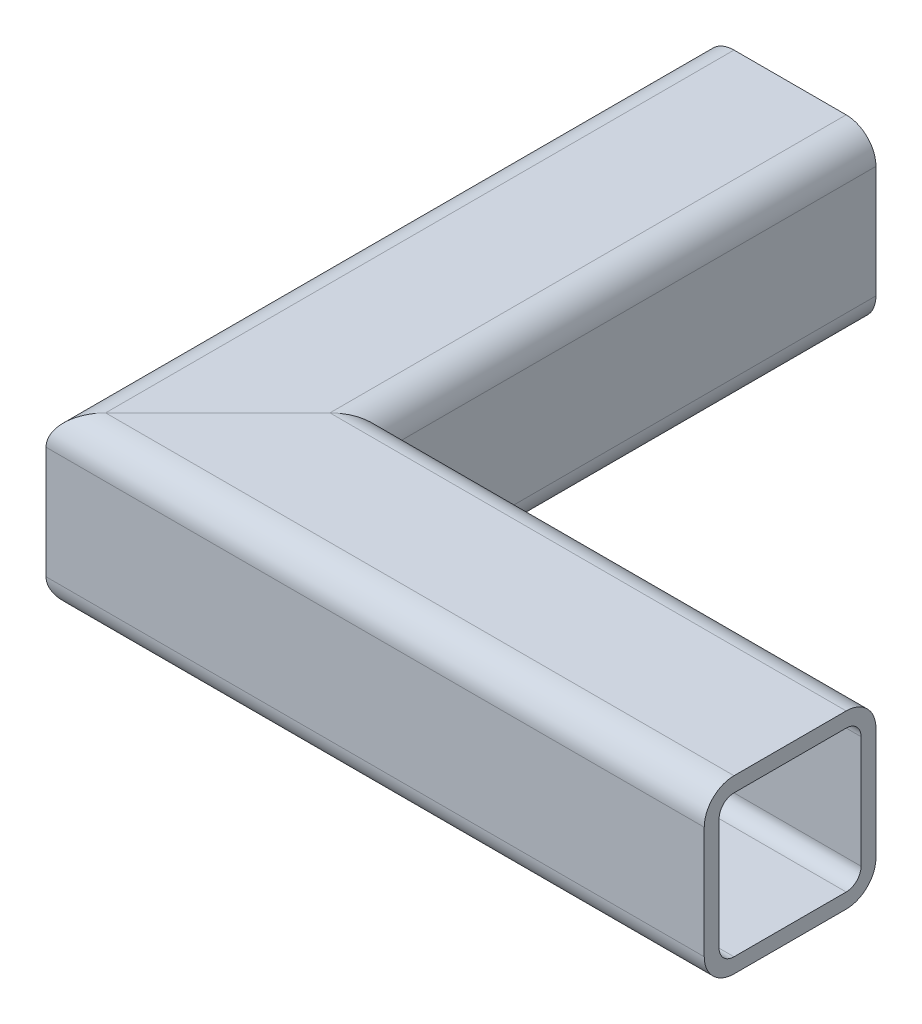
ISO-10303-21;
HEADER;
FILE_DESCRIPTION(('STEP AP214'),'2;1');
FILE_NAME('part.step','',(''),(''),'','','');
FILE_SCHEMA(('AUTOMOTIVE_DESIGN { 1 0 10303 214 1 1 1 1 }'));
ENDSEC;
DATA;
#1=APPLICATION_CONTEXT('core data for automotive mechanical design processes');
#2=APPLICATION_PROTOCOL_DEFINITION('international standard','automotive_design',2000,#1);
#3=PRODUCT_CONTEXT('',#1,'mechanical');
#4=PRODUCT('Part','Part','',(#3));
#5=PRODUCT_RELATED_PRODUCT_CATEGORY('part','',(#4));
#6=PRODUCT_DEFINITION_FORMATION('','',#4);
#7=PRODUCT_DEFINITION_CONTEXT('part definition',#1,'design');
#8=PRODUCT_DEFINITION('design','',#6,#7);
#9=PRODUCT_DEFINITION_SHAPE('','',#8);
#10=(LENGTH_UNIT() NAMED_UNIT(*) SI_UNIT(.MILLI.,.METRE.));
#11=(NAMED_UNIT(*) PLANE_ANGLE_UNIT() SI_UNIT($,.RADIAN.));
#12=(NAMED_UNIT(*) SI_UNIT($,.STERADIAN.) SOLID_ANGLE_UNIT());
#13=UNCERTAINTY_MEASURE_WITH_UNIT(LENGTH_MEASURE(1.E-05),#10,'distance_accuracy_value','');
#14=(GEOMETRIC_REPRESENTATION_CONTEXT(3) GLOBAL_UNCERTAINTY_ASSIGNED_CONTEXT((#13)) GLOBAL_UNIT_ASSIGNED_CONTEXT((#10,
#11,#12)) REPRESENTATION_CONTEXT('',''));
#15=CARTESIAN_POINT('',(0.,0.,0.));
#16=DIRECTION('',(0.,0.,1.));
#17=DIRECTION('',(1.,0.,0.));
#18=AXIS2_PLACEMENT_3D('',#15,#16,#17);
#19=CARTESIAN_POINT('',(-12.4,-9.8,0.));
#20=DIRECTION('',(1.,0.,0.));
#21=DIRECTION('',(0.,0.,-1.));
#22=AXIS2_PLACEMENT_3D('',#19,#20,#21);
#23=PLANE('',#22);
#24=DIRECTION('',(0.,1.,0.));
#25=VECTOR('',#24,1.);
#26=CARTESIAN_POINT('',(-12.4,-9.8,12.4));
#27=LINE('',#26,#25);
#28=CARTESIAN_POINT('',(-12.4,-9.8,12.4));
#29=VERTEX_POINT('',#28);
#30=CARTESIAN_POINT('',(-12.4,9.8,12.4));
#31=VERTEX_POINT('',#30);
#32=EDGE_CURVE('E13',#29,#31,#27,.T.);
#33=ORIENTED_EDGE('',*,*,#32,.F.);
#34=DIRECTION('',(0.,0.,-1.));
#35=VECTOR('',#34,1.);
#36=CARTESIAN_POINT('',(-12.4,-9.8,0.));
#37=LINE('',#36,#35);
#38=CARTESIAN_POINT('',(-12.4,-9.8,-100.));
#39=VERTEX_POINT('',#38);
#40=EDGE_CURVE('E356',#29,#39,#37,.T.);
#41=ORIENTED_EDGE('',*,*,#40,.T.);
#42=DIRECTION('',(0.,-1.,0.));
#43=VECTOR('',#42,1.);
#44=CARTESIAN_POINT('',(-12.4,-9.8,-100.));
#45=LINE('',#44,#43);
#46=CARTESIAN_POINT('',(-12.4,9.8,-100.));
#47=VERTEX_POINT('',#46);
#48=EDGE_CURVE('E314',#47,#39,#45,.T.);
#49=ORIENTED_EDGE('',*,*,#48,.F.);
#50=DIRECTION('',(0.,0.,-1.));
#51=VECTOR('',#50,1.);
#52=CARTESIAN_POINT('',(-12.4,9.8,0.));
#53=LINE('',#52,#51);
#54=EDGE_CURVE('E289',#31,#47,#53,.T.);
#55=ORIENTED_EDGE('',*,*,#54,.F.);
#56=EDGE_LOOP('',(#33,#41,#49,#55));
#57=FACE_BOUND('',#56,.T.);
#58=ADVANCED_FACE('F153',(#57),#23,.T.);
#59=CARTESIAN_POINT('',(-9.8,-9.8,0.));
#60=DIRECTION('',(0.,0.,-1.));
#61=DIRECTION('',(-1.,0.,0.));
#62=AXIS2_PLACEMENT_3D('',#59,#60,#61);
#63=CYLINDRICAL_SURFACE('',#62,2.6);
#64=CARTESIAN_POINT('',(-9.8,-9.8,9.8));
#65=DIRECTION('',(-0.707106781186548,0.,-0.707106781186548));
#66=DIRECTION('',(0.707106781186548,0.,-0.707106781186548));
#67=AXIS2_PLACEMENT_3D('',#64,#65,#66);
#68=ELLIPSE('',#67,3.67695526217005,2.6);
#69=CARTESIAN_POINT('',(-9.8,-12.4,9.8));
#70=VERTEX_POINT('',#69);
#71=EDGE_CURVE('E397',#70,#29,#68,.T.);
#72=ORIENTED_EDGE('',*,*,#71,.F.);
#73=DIRECTION('',(0.,0.,-1.));
#74=VECTOR('',#73,1.);
#75=CARTESIAN_POINT('',(-9.8,-12.4,0.));
#76=LINE('',#75,#74);
#77=CARTESIAN_POINT('',(-9.8,-12.4,-100.));
#78=VERTEX_POINT('',#77);
#79=EDGE_CURVE('E358',#70,#78,#76,.T.);
#80=ORIENTED_EDGE('',*,*,#79,.T.);
#81=CARTESIAN_POINT('',(-9.8,-9.8,-100.));
#82=DIRECTION('',(0.,0.,1.));
#83=DIRECTION('',(1.,0.,0.));
#84=AXIS2_PLACEMENT_3D('',#81,#82,#83);
#85=CIRCLE('',#84,2.6);
#86=EDGE_CURVE('E311',#39,#78,#85,.T.);
#87=ORIENTED_EDGE('',*,*,#86,.F.);
#88=ORIENTED_EDGE('',*,*,#40,.F.);
#89=EDGE_LOOP('',(#72,#80,#87,#88));
#90=FACE_BOUND('',#89,.T.);
#91=ADVANCED_FACE('F414',(#90),#63,.F.);
#92=CARTESIAN_POINT('',(-9.8,-12.4,0.));
#93=DIRECTION('',(0.,1.,0.));
#94=DIRECTION('',(0.,0.,1.));
#95=AXIS2_PLACEMENT_3D('',#92,#93,#94);
#96=PLANE('',#95);
#97=DIRECTION('',(-0.707106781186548,0.,0.707106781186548));
#98=VECTOR('',#97,1.);
#99=CARTESIAN_POINT('',(-4.9,-12.4,4.9));
#100=LINE('',#99,#98);
#101=CARTESIAN_POINT('',(9.80000000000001,-12.4,-9.8));
#102=VERTEX_POINT('',#101);
#103=EDGE_CURVE('E201',#102,#70,#100,.T.);
#104=ORIENTED_EDGE('',*,*,#103,.F.);
#105=DIRECTION('',(0.,0.,-1.));
#106=VECTOR('',#105,1.);
#107=CARTESIAN_POINT('',(9.8,-12.4,0.));
#108=LINE('',#107,#106);
#109=CARTESIAN_POINT('',(9.80000000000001,-12.4,-100.));
#110=VERTEX_POINT('',#109);
#111=EDGE_CURVE('E360',#102,#110,#108,.T.);
#112=ORIENTED_EDGE('',*,*,#111,.T.);
#113=DIRECTION('',(1.,0.,0.));
#114=VECTOR('',#113,1.);
#115=CARTESIAN_POINT('',(-9.8,-12.4,-100.));
#116=LINE('',#115,#114);
#117=EDGE_CURVE('E308',#78,#110,#116,.T.);
#118=ORIENTED_EDGE('',*,*,#117,.F.);
#119=ORIENTED_EDGE('',*,*,#79,.F.);
#120=EDGE_LOOP('',(#104,#112,#118,#119));
#121=FACE_BOUND('',#120,.T.);
#122=ADVANCED_FACE('F406',(#121),#96,.T.);
#123=CARTESIAN_POINT('',(9.8,-9.8,0.));
#124=DIRECTION('',(0.,0.,-1.));
#125=DIRECTION('',(-1.,0.,0.));
#126=AXIS2_PLACEMENT_3D('',#123,#124,#125);
#127=CYLINDRICAL_SURFACE('',#126,2.6);
#128=CARTESIAN_POINT('',(9.8,-9.8,-9.8));
#129=DIRECTION('',(-0.707106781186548,0.,-0.707106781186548));
#130=DIRECTION('',(0.707106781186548,0.,-0.707106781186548));
#131=AXIS2_PLACEMENT_3D('',#128,#129,#130);
#132=ELLIPSE('',#131,3.67695526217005,2.6);
#133=CARTESIAN_POINT('',(12.4,-9.8,-12.4));
#134=VERTEX_POINT('',#133);
#135=EDGE_CURVE('E376',#134,#102,#132,.T.);
#136=ORIENTED_EDGE('',*,*,#135,.F.);
#137=DIRECTION('',(0.,0.,-1.));
#138=VECTOR('',#137,1.);
#139=CARTESIAN_POINT('',(12.4,-9.8,0.));
#140=LINE('',#139,#138);
#141=CARTESIAN_POINT('',(12.4,-9.8,-100.));
#142=VERTEX_POINT('',#141);
#143=EDGE_CURVE('E362',#134,#142,#140,.T.);
#144=ORIENTED_EDGE('',*,*,#143,.T.);
#145=CARTESIAN_POINT('',(9.80000000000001,-9.8,-100.));
#146=DIRECTION('',(0.,0.,1.));
#147=DIRECTION('',(1.,0.,0.));
#148=AXIS2_PLACEMENT_3D('',#145,#146,#147);
#149=CIRCLE('',#148,2.6);
#150=EDGE_CURVE('E305',#110,#142,#149,.T.);
#151=ORIENTED_EDGE('',*,*,#150,.F.);
#152=ORIENTED_EDGE('',*,*,#111,.F.);
#153=EDGE_LOOP('',(#136,#144,#151,#152));
#154=FACE_BOUND('',#153,.T.);
#155=ADVANCED_FACE('F409',(#154),#127,.F.);
#156=CARTESIAN_POINT('',(12.4,9.8,0.));
#157=DIRECTION('',(-1.,0.,0.));
#158=DIRECTION('',(0.,0.,1.));
#159=AXIS2_PLACEMENT_3D('',#156,#157,#158);
#160=PLANE('',#159);
#161=DIRECTION('',(0.,-1.,0.));
#162=VECTOR('',#161,1.);
#163=CARTESIAN_POINT('',(12.4,9.8,-12.4));
#164=LINE('',#163,#162);
#165=CARTESIAN_POINT('',(12.4,9.8,-12.4));
#166=VERTEX_POINT('',#165);
#167=EDGE_CURVE('E372',#166,#134,#164,.T.);
#168=ORIENTED_EDGE('',*,*,#167,.F.);
#169=DIRECTION('',(0.,0.,-1.));
#170=VECTOR('',#169,1.);
#171=CARTESIAN_POINT('',(12.4,9.8,0.));
#172=LINE('',#171,#170);
#173=CARTESIAN_POINT('',(12.4,9.8,-100.));
#174=VERTEX_POINT('',#173);
#175=EDGE_CURVE('E364',#166,#174,#172,.T.);
#176=ORIENTED_EDGE('',*,*,#175,.T.);
#177=DIRECTION('',(0.,1.,0.));
#178=VECTOR('',#177,1.);
#179=CARTESIAN_POINT('',(12.4,9.8,-100.));
#180=LINE('',#179,#178);
#181=EDGE_CURVE('E300',#142,#174,#180,.T.);
#182=ORIENTED_EDGE('',*,*,#181,.F.);
#183=ORIENTED_EDGE('',*,*,#143,.F.);
#184=EDGE_LOOP('',(#168,#176,#182,#183));
#185=FACE_BOUND('',#184,.T.);
#186=ADVANCED_FACE('F431',(#185),#160,.T.);
#187=CARTESIAN_POINT('',(9.80000000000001,9.8,0.));
#188=DIRECTION('',(0.,0.,-1.));
#189=DIRECTION('',(-1.,0.,0.));
#190=AXIS2_PLACEMENT_3D('',#187,#188,#189);
#191=CYLINDRICAL_SURFACE('',#190,2.6);
#192=CARTESIAN_POINT('',(9.8,9.8,-9.8));
#193=DIRECTION('',(-0.707106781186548,0.,-0.707106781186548));
#194=DIRECTION('',(0.707106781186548,0.,-0.707106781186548));
#195=AXIS2_PLACEMENT_3D('',#192,#193,#194);
#196=ELLIPSE('',#195,3.67695526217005,2.6);
#197=CARTESIAN_POINT('',(9.8,12.4,-9.8));
#198=VERTEX_POINT('',#197);
#199=EDGE_CURVE('E370',#198,#166,#196,.T.);
#200=ORIENTED_EDGE('',*,*,#199,.F.);
#201=DIRECTION('',(0.,0.,-1.));
#202=VECTOR('',#201,1.);
#203=CARTESIAN_POINT('',(9.8,12.4,0.));
#204=LINE('',#203,#202);
#205=CARTESIAN_POINT('',(9.80000000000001,12.4,-100.));
#206=VERTEX_POINT('',#205);
#207=EDGE_CURVE('E285',#198,#206,#204,.T.);
#208=ORIENTED_EDGE('',*,*,#207,.T.);
#209=CARTESIAN_POINT('',(9.80000000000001,9.8,-100.));
#210=DIRECTION('',(0.,0.,1.));
#211=DIRECTION('',(1.,0.,0.));
#212=AXIS2_PLACEMENT_3D('',#209,#210,#211);
#213=CIRCLE('',#212,2.6);
#214=EDGE_CURVE('E298',#174,#206,#213,.T.);
#215=ORIENTED_EDGE('',*,*,#214,.F.);
#216=ORIENTED_EDGE('',*,*,#175,.F.);
#217=EDGE_LOOP('',(#200,#208,#215,#216));
#218=FACE_BOUND('',#217,.T.);
#219=ADVANCED_FACE('F368',(#218),#191,.F.);
#220=CARTESIAN_POINT('',(9.8,12.4,0.));
#221=DIRECTION('',(0.,-1.,0.));
#222=DIRECTION('',(0.,0.,-1.));
#223=AXIS2_PLACEMENT_3D('',#220,#221,#222);
#224=PLANE('',#223);
#225=DIRECTION('',(0.707106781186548,0.,-0.707106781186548));
#226=VECTOR('',#225,1.);
#227=CARTESIAN_POINT('',(4.9,12.4,-4.9));
#228=LINE('',#227,#226);
#229=CARTESIAN_POINT('',(-9.80000000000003,12.4,9.80000000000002));
#230=VERTEX_POINT('',#229);
#231=EDGE_CURVE('E281',#230,#198,#228,.T.);
#232=ORIENTED_EDGE('',*,*,#231,.F.);
#233=DIRECTION('',(0.,0.,-1.));
#234=VECTOR('',#233,1.);
#235=CARTESIAN_POINT('',(-9.8,12.4,0.));
#236=LINE('',#235,#234);
#237=CARTESIAN_POINT('',(-9.8,12.4,-100.));
#238=VERTEX_POINT('',#237);
#239=EDGE_CURVE('E274',#230,#238,#236,.T.);
#240=ORIENTED_EDGE('',*,*,#239,.T.);
#241=DIRECTION('',(-1.,0.,0.));
#242=VECTOR('',#241,1.);
#243=CARTESIAN_POINT('',(9.80000000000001,12.4,-100.));
#244=LINE('',#243,#242);
#245=EDGE_CURVE('E279',#206,#238,#244,.T.);
#246=ORIENTED_EDGE('',*,*,#245,.F.);
#247=ORIENTED_EDGE('',*,*,#207,.F.);
#248=EDGE_LOOP('',(#232,#240,#246,#247));
#249=FACE_BOUND('',#248,.T.);
#250=ADVANCED_FACE('F276',(#249),#224,.T.);
#251=CARTESIAN_POINT('',(-9.8,9.8,0.));
#252=DIRECTION('',(0.,0.,-1.));
#253=DIRECTION('',(-1.,0.,0.));
#254=AXIS2_PLACEMENT_3D('',#251,#252,#253);
#255=CYLINDRICAL_SURFACE('',#254,2.6);
#256=CARTESIAN_POINT('',(-9.8,9.8,9.8));
#257=DIRECTION('',(-0.707106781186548,0.,-0.707106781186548));
#258=DIRECTION('',(0.707106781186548,0.,-0.707106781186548));
#259=AXIS2_PLACEMENT_3D('',#256,#257,#258);
#260=ELLIPSE('',#259,3.67695526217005,2.6);
#261=EDGE_CURVE('E374',#31,#230,#260,.T.);
#262=ORIENTED_EDGE('',*,*,#261,.F.);
#263=ORIENTED_EDGE('',*,*,#54,.T.);
#264=CARTESIAN_POINT('',(-9.8,9.8,-100.));
#265=DIRECTION('',(0.,0.,1.));
#266=DIRECTION('',(1.,0.,0.));
#267=AXIS2_PLACEMENT_3D('',#264,#265,#266);
#268=CIRCLE('',#267,2.6);
#269=EDGE_CURVE('E287',#238,#47,#268,.T.);
#270=ORIENTED_EDGE('',*,*,#269,.F.);
#271=ORIENTED_EDGE('',*,*,#239,.F.);
#272=EDGE_LOOP('',(#262,#263,#270,#271));
#273=FACE_BOUND('',#272,.T.);
#274=ADVANCED_FACE('F155',(#273),#255,.F.);
#275=CARTESIAN_POINT('',(9.80000000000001,9.8,-100.));
#276=DIRECTION('',(0.,0.,1.));
#277=DIRECTION('',(1.,0.,0.));
#278=AXIS2_PLACEMENT_3D('',#275,#276,#277);
#279=PLANE('',#278);
#280=ORIENTED_EDGE('',*,*,#269,.T.);
#281=ORIENTED_EDGE('',*,*,#48,.T.);
#282=ORIENTED_EDGE('',*,*,#86,.T.);
#283=ORIENTED_EDGE('',*,*,#117,.T.);
#284=ORIENTED_EDGE('',*,*,#150,.T.);
#285=ORIENTED_EDGE('',*,*,#181,.T.);
#286=ORIENTED_EDGE('',*,*,#214,.T.);
#287=ORIENTED_EDGE('',*,*,#245,.T.);
#288=EDGE_LOOP('',(#280,#281,#282,#283,#284,#285,#286,#287));
#289=FACE_BOUND('',#288,.T.);
#290=CARTESIAN_POINT('',(9.80000000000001,9.8,-100.));
#291=DIRECTION('',(0.,0.,1.));
#292=DIRECTION('',(1.,0.,0.));
#293=AXIS2_PLACEMENT_3D('',#290,#291,#292);
#294=CIRCLE('',#293,5.2);
#295=CARTESIAN_POINT('',(15.,9.8,-100.));
#296=VERTEX_POINT('',#295);
#297=CARTESIAN_POINT('',(9.80000000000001,15.,-100.));
#298=VERTEX_POINT('',#297);
#299=EDGE_CURVE('E316',#296,#298,#294,.T.);
#300=ORIENTED_EDGE('',*,*,#299,.F.);
#301=DIRECTION('',(0.,1.,0.));
#302=VECTOR('',#301,1.);
#303=CARTESIAN_POINT('',(15.,9.8,-100.));
#304=LINE('',#303,#302);
#305=CARTESIAN_POINT('',(15.,-9.8,-100.));
#306=VERTEX_POINT('',#305);
#307=EDGE_CURVE('E337',#306,#296,#304,.T.);
#308=ORIENTED_EDGE('',*,*,#307,.F.);
#309=CARTESIAN_POINT('',(9.80000000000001,-9.8,-100.));
#310=DIRECTION('',(0.,0.,1.));
#311=DIRECTION('',(1.,0.,0.));
#312=AXIS2_PLACEMENT_3D('',#309,#310,#311);
#313=CIRCLE('',#312,5.2);
#314=CARTESIAN_POINT('',(9.80000000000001,-15.,-100.));
#315=VERTEX_POINT('',#314);
#316=EDGE_CURVE('E334',#315,#306,#313,.T.);
#317=ORIENTED_EDGE('',*,*,#316,.F.);
#318=DIRECTION('',(1.,0.,0.));
#319=VECTOR('',#318,1.);
#320=CARTESIAN_POINT('',(-9.8,-15.,-100.));
#321=LINE('',#320,#319);
#322=CARTESIAN_POINT('',(-9.8,-15.,-100.));
#323=VERTEX_POINT('',#322);
#324=EDGE_CURVE('E331',#323,#315,#321,.T.);
#325=ORIENTED_EDGE('',*,*,#324,.F.);
#326=CARTESIAN_POINT('',(-9.8,-9.8,-100.));
#327=DIRECTION('',(0.,0.,1.));
#328=DIRECTION('',(1.,0.,0.));
#329=AXIS2_PLACEMENT_3D('',#326,#327,#328);
#330=CIRCLE('',#329,5.2);
#331=CARTESIAN_POINT('',(-15.,-9.8,-100.));
#332=VERTEX_POINT('',#331);
#333=EDGE_CURVE('E328',#332,#323,#330,.T.);
#334=ORIENTED_EDGE('',*,*,#333,.F.);
#335=DIRECTION('',(0.,-1.,0.));
#336=VECTOR('',#335,1.);
#337=CARTESIAN_POINT('',(-15.,-9.8,-100.));
#338=LINE('',#337,#336);
#339=CARTESIAN_POINT('',(-15.,9.8,-100.));
#340=VERTEX_POINT('',#339);
#341=EDGE_CURVE('E325',#340,#332,#338,.T.);
#342=ORIENTED_EDGE('',*,*,#341,.F.);
#343=CARTESIAN_POINT('',(-9.8,9.8,-100.));
#344=DIRECTION('',(0.,0.,1.));
#345=DIRECTION('',(1.,0.,0.));
#346=AXIS2_PLACEMENT_3D('',#343,#344,#345);
#347=CIRCLE('',#346,5.2);
#348=CARTESIAN_POINT('',(-9.8,15.,-100.));
#349=VERTEX_POINT('',#348);
#350=EDGE_CURVE('E322',#349,#340,#347,.T.);
#351=ORIENTED_EDGE('',*,*,#350,.F.);
#352=DIRECTION('',(-1.,0.,0.));
#353=VECTOR('',#352,1.);
#354=CARTESIAN_POINT('',(9.80000000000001,15.,-100.));
#355=LINE('',#354,#353);
#356=EDGE_CURVE('E319',#298,#349,#355,.T.);
#357=ORIENTED_EDGE('',*,*,#356,.F.);
#358=EDGE_LOOP('',(#300,#308,#317,#325,#334,#342,#351,#357));
#359=FACE_BOUND('',#358,.T.);
#360=ADVANCED_FACE('F294',(#289,#359),#279,.F.);
#361=CARTESIAN_POINT('',(15.,9.8,0.));
#362=DIRECTION('',(-1.,0.,0.));
#363=DIRECTION('',(0.,0.,1.));
#364=AXIS2_PLACEMENT_3D('',#361,#362,#363);
#365=PLANE('',#364);
#366=DIRECTION('',(0.,0.,-1.));
#367=VECTOR('',#366,1.);
#368=CARTESIAN_POINT('',(15.,9.8,0.));
#369=LINE('',#368,#367);
#370=CARTESIAN_POINT('',(15.,9.8,-15.));
#371=VERTEX_POINT('',#370);
#372=EDGE_CURVE('E284',#371,#296,#369,.T.);
#373=ORIENTED_EDGE('',*,*,#372,.F.);
#374=DIRECTION('',(0.,-1.,0.));
#375=VECTOR('',#374,1.);
#376=CARTESIAN_POINT('',(15.,9.8,-15.));
#377=LINE('',#376,#375);
#378=CARTESIAN_POINT('',(15.,-9.8,-15.));
#379=VERTEX_POINT('',#378);
#380=EDGE_CURVE('E157',#371,#379,#377,.T.);
#381=ORIENTED_EDGE('',*,*,#380,.T.);
#382=DIRECTION('',(0.,0.,-1.));
#383=VECTOR('',#382,1.);
#384=CARTESIAN_POINT('',(15.,-9.8,0.));
#385=LINE('',#384,#383);
#386=EDGE_CURVE('E341',#379,#306,#385,.T.);
#387=ORIENTED_EDGE('',*,*,#386,.T.);
#388=ORIENTED_EDGE('',*,*,#307,.T.);
#389=EDGE_LOOP('',(#373,#381,#387,#388));
#390=FACE_BOUND('',#389,.T.);
#391=ADVANCED_FACE('F443',(#390),#365,.F.);
#392=CARTESIAN_POINT('',(9.8,-9.8,0.));
#393=DIRECTION('',(0.,0.,-1.));
#394=DIRECTION('',(-1.,0.,0.));
#395=AXIS2_PLACEMENT_3D('',#392,#393,#394);
#396=CYLINDRICAL_SURFACE('',#395,5.2);
#397=ORIENTED_EDGE('',*,*,#386,.F.);
#398=CARTESIAN_POINT('',(9.8,-9.8,-9.8));
#399=DIRECTION('',(-0.707106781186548,0.,-0.707106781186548));
#400=DIRECTION('',(0.707106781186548,0.,-0.707106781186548));
#401=AXIS2_PLACEMENT_3D('',#398,#399,#400);
#402=ELLIPSE('',#401,7.35391052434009,5.2);
#403=CARTESIAN_POINT('',(9.80000000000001,-15.,-9.8));
#404=VERTEX_POINT('',#403);
#405=EDGE_CURVE('E379',#379,#404,#402,.T.);
#406=ORIENTED_EDGE('',*,*,#405,.T.);
#407=DIRECTION('',(0.,0.,-1.));
#408=VECTOR('',#407,1.);
#409=CARTESIAN_POINT('',(9.80000000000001,-15.,0.));
#410=LINE('',#409,#408);
#411=EDGE_CURVE('E343',#404,#315,#410,.T.);
#412=ORIENTED_EDGE('',*,*,#411,.T.);
#413=ORIENTED_EDGE('',*,*,#316,.T.);
#414=EDGE_LOOP('',(#397,#406,#412,#413));
#415=FACE_BOUND('',#414,.T.);
#416=ADVANCED_FACE('F448',(#415),#396,.T.);
#417=CARTESIAN_POINT('',(-9.8,-15.,0.));
#418=DIRECTION('',(0.,1.,0.));
#419=DIRECTION('',(0.,0.,1.));
#420=AXIS2_PLACEMENT_3D('',#417,#418,#419);
#421=PLANE('',#420);
#422=ORIENTED_EDGE('',*,*,#411,.F.);
#423=DIRECTION('',(-0.707106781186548,0.,0.707106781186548));
#424=VECTOR('',#423,1.);
#425=CARTESIAN_POINT('',(-4.9,-15.,4.9));
#426=LINE('',#425,#424);
#427=CARTESIAN_POINT('',(-9.80000000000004,-15.,9.80000000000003));
#428=VERTEX_POINT('',#427);
#429=EDGE_CURVE('E188',#404,#428,#426,.T.);
#430=ORIENTED_EDGE('',*,*,#429,.T.);
#431=DIRECTION('',(0.,0.,-1.));
#432=VECTOR('',#431,1.);
#433=CARTESIAN_POINT('',(-9.8,-15.,0.));
#434=LINE('',#433,#432);
#435=EDGE_CURVE('E345',#428,#323,#434,.T.);
#436=ORIENTED_EDGE('',*,*,#435,.T.);
#437=ORIENTED_EDGE('',*,*,#324,.T.);
#438=EDGE_LOOP('',(#422,#430,#436,#437));
#439=FACE_BOUND('',#438,.T.);
#440=ADVANCED_FACE('F455',(#439),#421,.F.);
#441=CARTESIAN_POINT('',(-9.8,-9.8,0.));
#442=DIRECTION('',(0.,0.,-1.));
#443=DIRECTION('',(-1.,0.,0.));
#444=AXIS2_PLACEMENT_3D('',#441,#442,#443);
#445=CYLINDRICAL_SURFACE('',#444,5.2);
#446=ORIENTED_EDGE('',*,*,#435,.F.);
#447=CARTESIAN_POINT('',(-9.8,-9.8,9.8));
#448=DIRECTION('',(-0.707106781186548,0.,-0.707106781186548));
#449=DIRECTION('',(0.707106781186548,0.,-0.707106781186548));
#450=AXIS2_PLACEMENT_3D('',#447,#448,#449);
#451=ELLIPSE('',#450,7.35391052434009,5.2);
#452=CARTESIAN_POINT('',(-15.,-9.8,15.));
#453=VERTEX_POINT('',#452);
#454=EDGE_CURVE('E384',#428,#453,#451,.T.);
#455=ORIENTED_EDGE('',*,*,#454,.T.);
#456=DIRECTION('',(0.,0.,-1.));
#457=VECTOR('',#456,1.);
#458=CARTESIAN_POINT('',(-15.,-9.8,0.));
#459=LINE('',#458,#457);
#460=EDGE_CURVE('E347',#453,#332,#459,.T.);
#461=ORIENTED_EDGE('',*,*,#460,.T.);
#462=ORIENTED_EDGE('',*,*,#333,.T.);
#463=EDGE_LOOP('',(#446,#455,#461,#462));
#464=FACE_BOUND('',#463,.T.);
#465=ADVANCED_FACE('F458',(#464),#445,.T.);
#466=CARTESIAN_POINT('',(-15.,-9.8,0.));
#467=DIRECTION('',(1.,0.,0.));
#468=DIRECTION('',(0.,0.,-1.));
#469=AXIS2_PLACEMENT_3D('',#466,#467,#468);
#470=PLANE('',#469);
#471=ORIENTED_EDGE('',*,*,#460,.F.);
#472=DIRECTION('',(0.,1.,0.));
#473=VECTOR('',#472,1.);
#474=CARTESIAN_POINT('',(-15.,-9.8,15.));
#475=LINE('',#474,#473);
#476=CARTESIAN_POINT('',(-15.,9.79999999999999,15.));
#477=VERTEX_POINT('',#476);
#478=EDGE_CURVE('E389',#453,#477,#475,.T.);
#479=ORIENTED_EDGE('',*,*,#478,.T.);
#480=DIRECTION('',(0.,0.,-1.));
#481=VECTOR('',#480,1.);
#482=CARTESIAN_POINT('',(-15.,9.8,0.));
#483=LINE('',#482,#481);
#484=EDGE_CURVE('E349',#477,#340,#483,.T.);
#485=ORIENTED_EDGE('',*,*,#484,.T.);
#486=ORIENTED_EDGE('',*,*,#341,.T.);
#487=EDGE_LOOP('',(#471,#479,#485,#486));
#488=FACE_BOUND('',#487,.T.);
#489=ADVANCED_FACE('F462',(#488),#470,.F.);
#490=CARTESIAN_POINT('',(-9.8,9.8,0.));
#491=DIRECTION('',(0.,0.,-1.));
#492=DIRECTION('',(-1.,0.,0.));
#493=AXIS2_PLACEMENT_3D('',#490,#491,#492);
#494=CYLINDRICAL_SURFACE('',#493,5.2);
#495=ORIENTED_EDGE('',*,*,#484,.F.);
#496=CARTESIAN_POINT('',(-9.8,9.8,9.8));
#497=DIRECTION('',(-0.707106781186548,0.,-0.707106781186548));
#498=DIRECTION('',(0.707106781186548,0.,-0.707106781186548));
#499=AXIS2_PLACEMENT_3D('',#496,#497,#498);
#500=ELLIPSE('',#499,7.35391052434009,5.2);
#501=CARTESIAN_POINT('',(-9.8,15.,9.8));
#502=VERTEX_POINT('',#501);
#503=EDGE_CURVE('E392',#477,#502,#500,.T.);
#504=ORIENTED_EDGE('',*,*,#503,.T.);
#505=DIRECTION('',(0.,0.,-1.));
#506=VECTOR('',#505,1.);
#507=CARTESIAN_POINT('',(-9.8,15.,0.));
#508=LINE('',#507,#506);
#509=EDGE_CURVE('E351',#502,#349,#508,.T.);
#510=ORIENTED_EDGE('',*,*,#509,.T.);
#511=ORIENTED_EDGE('',*,*,#350,.T.);
#512=EDGE_LOOP('',(#495,#504,#510,#511));
#513=FACE_BOUND('',#512,.T.);
#514=ADVANCED_FACE('F466',(#513),#494,.T.);
#515=CARTESIAN_POINT('',(9.80000000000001,15.,0.));
#516=DIRECTION('',(0.,-1.,0.));
#517=DIRECTION('',(0.,0.,-1.));
#518=AXIS2_PLACEMENT_3D('',#515,#516,#517);
#519=PLANE('',#518);
#520=ORIENTED_EDGE('',*,*,#509,.F.);
#521=DIRECTION('',(0.707106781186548,0.,-0.707106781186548));
#522=VECTOR('',#521,1.);
#523=CARTESIAN_POINT('',(4.9,15.,-4.9));
#524=LINE('',#523,#522);
#525=CARTESIAN_POINT('',(9.80000000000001,15.,-9.80000000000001));
#526=VERTEX_POINT('',#525);
#527=EDGE_CURVE('E172',#502,#526,#524,.T.);
#528=ORIENTED_EDGE('',*,*,#527,.T.);
#529=DIRECTION('',(0.,0.,-1.));
#530=VECTOR('',#529,1.);
#531=CARTESIAN_POINT('',(9.80000000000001,15.,0.));
#532=LINE('',#531,#530);
#533=EDGE_CURVE('E353',#526,#298,#532,.T.);
#534=ORIENTED_EDGE('',*,*,#533,.T.);
#535=ORIENTED_EDGE('',*,*,#356,.T.);
#536=EDGE_LOOP('',(#520,#528,#534,#535));
#537=FACE_BOUND('',#536,.T.);
#538=ADVANCED_FACE('F469',(#537),#519,.F.);
#539=CARTESIAN_POINT('',(9.80000000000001,9.8,0.));
#540=DIRECTION('',(0.,0.,-1.));
#541=DIRECTION('',(-1.,0.,0.));
#542=AXIS2_PLACEMENT_3D('',#539,#540,#541);
#543=CYLINDRICAL_SURFACE('',#542,5.2);
#544=ORIENTED_EDGE('',*,*,#533,.F.);
#545=CARTESIAN_POINT('',(9.8,9.8,-9.8));
#546=DIRECTION('',(-0.707106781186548,0.,-0.707106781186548));
#547=DIRECTION('',(0.707106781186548,0.,-0.707106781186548));
#548=AXIS2_PLACEMENT_3D('',#545,#546,#547);
#549=ELLIPSE('',#548,7.35391052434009,5.2);
#550=EDGE_CURVE('E163',#526,#371,#549,.T.);
#551=ORIENTED_EDGE('',*,*,#550,.T.);
#552=ORIENTED_EDGE('',*,*,#372,.T.);
#553=ORIENTED_EDGE('',*,*,#299,.T.);
#554=EDGE_LOOP('',(#544,#551,#552,#553));
#555=FACE_BOUND('',#554,.T.);
#556=ADVANCED_FACE('F424',(#555),#543,.T.);
#557=CARTESIAN_POINT('',(0.,0.,0.));
#558=DIRECTION('',(-0.707106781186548,0.,-0.707106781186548));
#559=DIRECTION('',(-0.707106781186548,0.,0.707106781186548));
#560=AXIS2_PLACEMENT_3D('',#557,#558,#559);
#561=PLANE('',#560);
#562=ORIENTED_EDGE('',*,*,#261,.T.);
#563=ORIENTED_EDGE('',*,*,#231,.T.);
#564=ORIENTED_EDGE('',*,*,#199,.T.);
#565=ORIENTED_EDGE('',*,*,#167,.T.);
#566=ORIENTED_EDGE('',*,*,#135,.T.);
#567=ORIENTED_EDGE('',*,*,#103,.T.);
#568=ORIENTED_EDGE('',*,*,#71,.T.);
#569=ORIENTED_EDGE('',*,*,#32,.T.);
#570=EDGE_LOOP('',(#562,#563,#564,#565,#566,#567,#568,#569));
#571=FACE_BOUND('',#570,.T.);
#572=ORIENTED_EDGE('',*,*,#527,.F.);
#573=ORIENTED_EDGE('',*,*,#503,.F.);
#574=ORIENTED_EDGE('',*,*,#478,.F.);
#575=ORIENTED_EDGE('',*,*,#454,.F.);
#576=ORIENTED_EDGE('',*,*,#429,.F.);
#577=ORIENTED_EDGE('',*,*,#405,.F.);
#578=ORIENTED_EDGE('',*,*,#380,.F.);
#579=ORIENTED_EDGE('',*,*,#550,.F.);
#580=EDGE_LOOP('',(#572,#573,#574,#575,#576,#577,#578,#579));
#581=FACE_BOUND('',#580,.T.);
#582=ADVANCED_FACE('F400',(#571,#581),#561,.F.);
#583=CLOSED_SHELL('',(#58,#91,#122,#155,#186,#219,#250,#274,#360,#391,#416,#440,#465,#489,#514,
#538,#556,#582));
#584=MANIFOLD_SOLID_BREP('B2',#583);
#585=CARTESIAN_POINT('',(100.,9.8,-9.8));
#586=DIRECTION('',(-1.,0.,0.));
#587=DIRECTION('',(0.,0.,1.));
#588=AXIS2_PLACEMENT_3D('',#585,#586,#587);
#589=CYLINDRICAL_SURFACE('',#588,5.2);
#590=CARTESIAN_POINT('',(9.8,9.8,-9.8));
#591=DIRECTION('',(-0.707106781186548,0.,-0.707106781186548));
#592=DIRECTION('',(-0.707106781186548,0.,0.707106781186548));
#593=AXIS2_PLACEMENT_3D('',#590,#591,#592);
#594=ELLIPSE('',#593,7.35391052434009,5.2);
#595=CARTESIAN_POINT('',(9.80000000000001,15.,-9.8));
#596=VERTEX_POINT('',#595);
#597=CARTESIAN_POINT('',(15.,9.8,-15.));
#598=VERTEX_POINT('',#597);
#599=EDGE_CURVE('E834',#596,#598,#594,.T.);
#600=ORIENTED_EDGE('',*,*,#599,.F.);
#601=DIRECTION('',(-1.,0.,0.));
#602=VECTOR('',#601,1.);
#603=CARTESIAN_POINT('',(100.,15.,-9.8));
#604=LINE('',#603,#602);
#605=CARTESIAN_POINT('',(100.,15.,-9.8));
#606=VERTEX_POINT('',#605);
#607=EDGE_CURVE('E890',#606,#596,#604,.T.);
#608=ORIENTED_EDGE('',*,*,#607,.F.);
#609=CARTESIAN_POINT('',(100.,9.8,-9.8));
#610=DIRECTION('',(1.,0.,0.));
#611=DIRECTION('',(0.,0.,-1.));
#612=AXIS2_PLACEMENT_3D('',#609,#610,#611);
#613=CIRCLE('',#612,5.2);
#614=CARTESIAN_POINT('',(100.,9.8,-15.));
#615=VERTEX_POINT('',#614);
#616=EDGE_CURVE('E919',#615,#606,#613,.T.);
#617=ORIENTED_EDGE('',*,*,#616,.F.);
#618=DIRECTION('',(-1.,0.,0.));
#619=VECTOR('',#618,1.);
#620=CARTESIAN_POINT('',(100.,9.8,-15.));
#621=LINE('',#620,#619);
#622=EDGE_CURVE('E895',#615,#598,#621,.T.);
#623=ORIENTED_EDGE('',*,*,#622,.T.);
#624=EDGE_LOOP('',(#600,#608,#617,#623));
#625=FACE_BOUND('',#624,.T.);
#626=ADVANCED_FACE('F680',(#625),#589,.T.);
#627=CARTESIAN_POINT('',(100.,15.,-9.8));
#628=DIRECTION('',(0.,-1.,0.));
#629=DIRECTION('',(0.,0.,-1.));
#630=AXIS2_PLACEMENT_3D('',#627,#628,#629);
#631=PLANE('',#630);
#632=DIRECTION('',(0.707106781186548,0.,-0.707106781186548));
#633=VECTOR('',#632,1.);
#634=CARTESIAN_POINT('',(54.9,15.,-54.9));
#635=LINE('',#634,#633);
#636=CARTESIAN_POINT('',(-9.80000000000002,15.,9.8));
#637=VERTEX_POINT('',#636);
#638=EDGE_CURVE('E839',#637,#596,#635,.T.);
#639=ORIENTED_EDGE('',*,*,#638,.F.);
#640=DIRECTION('',(-1.,0.,0.));
#641=VECTOR('',#640,1.);
#642=CARTESIAN_POINT('',(100.,15.,9.8));
#643=LINE('',#642,#641);
#644=CARTESIAN_POINT('',(100.,15.,9.8));
#645=VERTEX_POINT('',#644);
#646=EDGE_CURVE('E894',#645,#637,#643,.T.);
#647=ORIENTED_EDGE('',*,*,#646,.F.);
#648=DIRECTION('',(0.,0.,1.));
#649=VECTOR('',#648,1.);
#650=CARTESIAN_POINT('',(100.,15.,-9.8));
#651=LINE('',#650,#649);
#652=EDGE_CURVE('E964',#606,#645,#651,.T.);
#653=ORIENTED_EDGE('',*,*,#652,.F.);
#654=ORIENTED_EDGE('',*,*,#607,.T.);
#655=EDGE_LOOP('',(#639,#647,#653,#654));
#656=FACE_BOUND('',#655,.T.);
#657=ADVANCED_FACE('F994',(#656),#631,.F.);
#658=CARTESIAN_POINT('',(100.,9.8,9.8));
#659=DIRECTION('',(-1.,0.,0.));
#660=DIRECTION('',(0.,0.,1.));
#661=AXIS2_PLACEMENT_3D('',#658,#659,#660);
#662=CYLINDRICAL_SURFACE('',#661,5.2);
#663=CARTESIAN_POINT('',(-9.80000000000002,9.8,9.8));
#664=DIRECTION('',(-0.707106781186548,0.,-0.707106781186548));
#665=DIRECTION('',(-0.707106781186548,0.,0.707106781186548));
#666=AXIS2_PLACEMENT_3D('',#663,#664,#665);
#667=ELLIPSE('',#666,7.35391052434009,5.2);
#668=CARTESIAN_POINT('',(-15.,9.8,15.));
#669=VERTEX_POINT('',#668);
#670=EDGE_CURVE('E151',#669,#637,#667,.T.);
#671=ORIENTED_EDGE('',*,*,#670,.F.);
#672=DIRECTION('',(-1.,0.,0.));
#673=VECTOR('',#672,1.);
#674=CARTESIAN_POINT('',(100.,9.8,15.));
#675=LINE('',#674,#673);
#676=CARTESIAN_POINT('',(100.,9.8,15.));
#677=VERTEX_POINT('',#676);
#678=EDGE_CURVE('E899',#677,#669,#675,.T.);
#679=ORIENTED_EDGE('',*,*,#678,.F.);
#680=CARTESIAN_POINT('',(100.,9.8,9.8));
#681=DIRECTION('',(1.,0.,0.));
#682=DIRECTION('',(0.,0.,-1.));
#683=AXIS2_PLACEMENT_3D('',#680,#681,#682);
#684=CIRCLE('',#683,5.2);
#685=EDGE_CURVE('E966',#645,#677,#684,.T.);
#686=ORIENTED_EDGE('',*,*,#685,.F.);
#687=ORIENTED_EDGE('',*,*,#646,.T.);
#688=EDGE_LOOP('',(#671,#679,#686,#687));
#689=FACE_BOUND('',#688,.T.);
#690=ADVANCED_FACE('F999',(#689),#662,.T.);
#691=CARTESIAN_POINT('',(100.,-9.8,15.));
#692=DIRECTION('',(0.,0.,-1.));
#693=DIRECTION('',(-1.,0.,0.));
#694=AXIS2_PLACEMENT_3D('',#691,#692,#693);
#695=PLANE('',#694);
#696=DIRECTION('',(0.,1.,0.));
#697=VECTOR('',#696,1.);
#698=CARTESIAN_POINT('',(-15.,-9.8,15.));
#699=LINE('',#698,#697);
#700=CARTESIAN_POINT('',(-15.,-9.8,15.));
#701=VERTEX_POINT('',#700);
#702=EDGE_CURVE('E691',#701,#669,#699,.T.);
#703=ORIENTED_EDGE('',*,*,#702,.F.);
#704=DIRECTION('',(-1.,0.,0.));
#705=VECTOR('',#704,1.);
#706=CARTESIAN_POINT('',(100.,-9.8,15.));
#707=LINE('',#706,#705);
#708=CARTESIAN_POINT('',(100.,-9.8,15.));
#709=VERTEX_POINT('',#708);
#710=EDGE_CURVE('E903',#709,#701,#707,.T.);
#711=ORIENTED_EDGE('',*,*,#710,.F.);
#712=DIRECTION('',(0.,-1.,0.));
#713=VECTOR('',#712,1.);
#714=CARTESIAN_POINT('',(100.,-9.8,15.));
#715=LINE('',#714,#713);
#716=EDGE_CURVE('E969',#677,#709,#715,.T.);
#717=ORIENTED_EDGE('',*,*,#716,.F.);
#718=ORIENTED_EDGE('',*,*,#678,.T.);
#719=EDGE_LOOP('',(#703,#711,#717,#718));
#720=FACE_BOUND('',#719,.T.);
#721=ADVANCED_FACE('F1003',(#720),#695,.F.);
#722=CARTESIAN_POINT('',(100.,-9.8,9.8));
#723=DIRECTION('',(-1.,0.,0.));
#724=DIRECTION('',(0.,0.,1.));
#725=AXIS2_PLACEMENT_3D('',#722,#723,#724);
#726=CYLINDRICAL_SURFACE('',#725,5.2);
#727=CARTESIAN_POINT('',(-9.80000000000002,-9.8,9.8));
#728=DIRECTION('',(-0.707106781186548,0.,-0.707106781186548));
#729=DIRECTION('',(-0.707106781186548,0.,0.707106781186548));
#730=AXIS2_PLACEMENT_3D('',#727,#728,#729);
#731=ELLIPSE('',#730,7.35391052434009,5.2);
#732=CARTESIAN_POINT('',(-9.79999999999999,-15.,9.8));
#733=VERTEX_POINT('',#732);
#734=EDGE_CURVE('E847',#733,#701,#731,.T.);
#735=ORIENTED_EDGE('',*,*,#734,.F.);
#736=DIRECTION('',(-1.,0.,0.));
#737=VECTOR('',#736,1.);
#738=CARTESIAN_POINT('',(100.,-15.,9.8));
#739=LINE('',#738,#737);
#740=CARTESIAN_POINT('',(100.,-15.,9.8));
#741=VERTEX_POINT('',#740);
#742=EDGE_CURVE('E907',#741,#733,#739,.T.);
#743=ORIENTED_EDGE('',*,*,#742,.F.);
#744=CARTESIAN_POINT('',(100.,-9.8,9.8));
#745=DIRECTION('',(1.,0.,0.));
#746=DIRECTION('',(0.,0.,-1.));
#747=AXIS2_PLACEMENT_3D('',#744,#745,#746);
#748=CIRCLE('',#747,5.2);
#749=EDGE_CURVE('E972',#709,#741,#748,.T.);
#750=ORIENTED_EDGE('',*,*,#749,.F.);
#751=ORIENTED_EDGE('',*,*,#710,.T.);
#752=EDGE_LOOP('',(#735,#743,#750,#751));
#753=FACE_BOUND('',#752,.T.);
#754=ADVANCED_FACE('F1010',(#753),#726,.T.);
#755=CARTESIAN_POINT('',(100.,-15.,9.8));
#756=DIRECTION('',(0.,1.,0.));
#757=DIRECTION('',(0.,0.,1.));
#758=AXIS2_PLACEMENT_3D('',#755,#756,#757);
#759=PLANE('',#758);
#760=DIRECTION('',(-0.707106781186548,0.,0.707106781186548));
#761=VECTOR('',#760,1.);
#762=CARTESIAN_POINT('',(45.1,-15.,-45.1));
#763=LINE('',#762,#761);
#764=CARTESIAN_POINT('',(9.8,-15.,-9.8));
#765=VERTEX_POINT('',#764);
#766=EDGE_CURVE('E851',#765,#733,#763,.T.);
#767=ORIENTED_EDGE('',*,*,#766,.F.);
#768=DIRECTION('',(-1.,0.,0.));
#769=VECTOR('',#768,1.);
#770=CARTESIAN_POINT('',(100.,-15.,-9.8));
#771=LINE('',#770,#769);
#772=CARTESIAN_POINT('',(100.,-15.,-9.8));
#773=VERTEX_POINT('',#772);
#774=EDGE_CURVE('E911',#773,#765,#771,.T.);
#775=ORIENTED_EDGE('',*,*,#774,.F.);
#776=DIRECTION('',(0.,0.,-1.));
#777=VECTOR('',#776,1.);
#778=CARTESIAN_POINT('',(100.,-15.,9.8));
#779=LINE('',#778,#777);
#780=EDGE_CURVE('E975',#741,#773,#779,.T.);
#781=ORIENTED_EDGE('',*,*,#780,.F.);
#782=ORIENTED_EDGE('',*,*,#742,.T.);
#783=EDGE_LOOP('',(#767,#775,#781,#782));
#784=FACE_BOUND('',#783,.T.);
#785=ADVANCED_FACE('F1012',(#784),#759,.F.);
#786=CARTESIAN_POINT('',(100.,-9.8,-9.8));
#787=DIRECTION('',(-1.,0.,0.));
#788=DIRECTION('',(0.,0.,1.));
#789=AXIS2_PLACEMENT_3D('',#786,#787,#788);
#790=CYLINDRICAL_SURFACE('',#789,5.2);
#791=CARTESIAN_POINT('',(9.8,-9.8,-9.8));
#792=DIRECTION('',(-0.707106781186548,0.,-0.707106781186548));
#793=DIRECTION('',(-0.707106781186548,0.,0.707106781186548));
#794=AXIS2_PLACEMENT_3D('',#791,#792,#793);
#795=ELLIPSE('',#794,7.35391052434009,5.2);
#796=CARTESIAN_POINT('',(15.,-9.8,-15.));
#797=VERTEX_POINT('',#796);
#798=EDGE_CURVE('E855',#797,#765,#795,.T.);
#799=ORIENTED_EDGE('',*,*,#798,.F.);
#800=DIRECTION('',(-1.,0.,0.));
#801=VECTOR('',#800,1.);
#802=CARTESIAN_POINT('',(100.,-9.8,-15.));
#803=LINE('',#802,#801);
#804=CARTESIAN_POINT('',(100.,-9.8,-15.));
#805=VERTEX_POINT('',#804);
#806=EDGE_CURVE('E915',#805,#797,#803,.T.);
#807=ORIENTED_EDGE('',*,*,#806,.F.);
#808=CARTESIAN_POINT('',(100.,-9.8,-9.8));
#809=DIRECTION('',(1.,0.,0.));
#810=DIRECTION('',(0.,0.,-1.));
#811=AXIS2_PLACEMENT_3D('',#808,#809,#810);
#812=CIRCLE('',#811,5.2);
#813=EDGE_CURVE('E978',#773,#805,#812,.T.);
#814=ORIENTED_EDGE('',*,*,#813,.F.);
#815=ORIENTED_EDGE('',*,*,#774,.T.);
#816=EDGE_LOOP('',(#799,#807,#814,#815));
#817=FACE_BOUND('',#816,.T.);
#818=ADVANCED_FACE('F1015',(#817),#790,.T.);
#819=CARTESIAN_POINT('',(100.,9.8,9.8));
#820=DIRECTION('',(-1.,0.,0.));
#821=DIRECTION('',(0.,0.,1.));
#822=AXIS2_PLACEMENT_3D('',#819,#820,#821);
#823=CYLINDRICAL_SURFACE('',#822,2.6);
#824=DIRECTION('',(-1.,0.,0.));
#825=VECTOR('',#824,1.);
#826=CARTESIAN_POINT('',(100.,9.8,12.4));
#827=LINE('',#826,#825);
#828=CARTESIAN_POINT('',(100.,9.8,12.4));
#829=VERTEX_POINT('',#828);
#830=CARTESIAN_POINT('',(-12.4,9.8,12.4));
#831=VERTEX_POINT('',#830);
#832=EDGE_CURVE('E684',#829,#831,#827,.T.);
#833=ORIENTED_EDGE('',*,*,#832,.T.);
#834=CARTESIAN_POINT('',(-9.80000000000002,9.8,9.8));
#835=DIRECTION('',(-0.707106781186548,0.,-0.707106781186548));
#836=DIRECTION('',(-0.707106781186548,0.,0.707106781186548));
#837=AXIS2_PLACEMENT_3D('',#834,#835,#836);
#838=ELLIPSE('',#837,3.67695526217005,2.6);
#839=CARTESIAN_POINT('',(-9.8,12.4,9.8));
#840=VERTEX_POINT('',#839);
#841=EDGE_CURVE('E727',#831,#840,#838,.T.);
#842=ORIENTED_EDGE('',*,*,#841,.T.);
#843=DIRECTION('',(-1.,0.,0.));
#844=VECTOR('',#843,1.);
#845=CARTESIAN_POINT('',(100.,12.4,9.8));
#846=LINE('',#845,#844);
#847=CARTESIAN_POINT('',(100.,12.4,9.8));
#848=VERTEX_POINT('',#847);
#849=EDGE_CURVE('E801',#848,#840,#846,.T.);
#850=ORIENTED_EDGE('',*,*,#849,.F.);
#851=CARTESIAN_POINT('',(100.,9.8,9.8));
#852=DIRECTION('',(1.,0.,0.));
#853=DIRECTION('',(0.,0.,-1.));
#854=AXIS2_PLACEMENT_3D('',#851,#852,#853);
#855=CIRCLE('',#854,2.6);
#856=EDGE_CURVE('E804',#848,#829,#855,.T.);
#857=ORIENTED_EDGE('',*,*,#856,.T.);
#858=EDGE_LOOP('',(#833,#842,#850,#857));
#859=FACE_BOUND('',#858,.T.);
#860=ADVANCED_FACE('F803',(#859),#823,.F.);
#861=CARTESIAN_POINT('',(100.,12.4,-9.8));
#862=DIRECTION('',(0.,-1.,0.));
#863=DIRECTION('',(0.,0.,-1.));
#864=AXIS2_PLACEMENT_3D('',#861,#862,#863);
#865=PLANE('',#864);
#866=ORIENTED_EDGE('',*,*,#849,.T.);
#867=DIRECTION('',(0.707106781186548,0.,-0.707106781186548));
#868=VECTOR('',#867,1.);
#869=CARTESIAN_POINT('',(54.9,12.4,-54.9));
#870=LINE('',#869,#868);
#871=CARTESIAN_POINT('',(9.8,12.4,-9.8));
#872=VERTEX_POINT('',#871);
#873=EDGE_CURVE('E700',#840,#872,#870,.T.);
#874=ORIENTED_EDGE('',*,*,#873,.T.);
#875=DIRECTION('',(-1.,0.,0.));
#876=VECTOR('',#875,1.);
#877=CARTESIAN_POINT('',(100.,12.4,-9.8));
#878=LINE('',#877,#876);
#879=CARTESIAN_POINT('',(100.,12.4,-9.8));
#880=VERTEX_POINT('',#879);
#881=EDGE_CURVE('E796',#880,#872,#878,.T.);
#882=ORIENTED_EDGE('',*,*,#881,.F.);
#883=DIRECTION('',(0.,0.,1.));
#884=VECTOR('',#883,1.);
#885=CARTESIAN_POINT('',(100.,12.4,-9.8));
#886=LINE('',#885,#884);
#887=EDGE_CURVE('E812',#880,#848,#886,.T.);
#888=ORIENTED_EDGE('',*,*,#887,.T.);
#889=EDGE_LOOP('',(#866,#874,#882,#888));
#890=FACE_BOUND('',#889,.T.);
#891=ADVANCED_FACE('F819',(#890),#865,.T.);
#892=CARTESIAN_POINT('',(100.,9.8,-9.8));
#893=DIRECTION('',(-1.,0.,0.));
#894=DIRECTION('',(0.,0.,1.));
#895=AXIS2_PLACEMENT_3D('',#892,#893,#894);
#896=CYLINDRICAL_SURFACE('',#895,2.6);
#897=ORIENTED_EDGE('',*,*,#881,.T.);
#898=CARTESIAN_POINT('',(9.8,9.8,-9.8));
#899=DIRECTION('',(-0.707106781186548,0.,-0.707106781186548));
#900=DIRECTION('',(-0.707106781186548,0.,0.707106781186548));
#901=AXIS2_PLACEMENT_3D('',#898,#899,#900);
#902=ELLIPSE('',#901,3.67695526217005,2.6);
#903=CARTESIAN_POINT('',(12.4,9.8,-12.4));
#904=VERTEX_POINT('',#903);
#905=EDGE_CURVE('E824',#872,#904,#902,.T.);
#906=ORIENTED_EDGE('',*,*,#905,.T.);
#907=DIRECTION('',(-1.,0.,0.));
#908=VECTOR('',#907,1.);
#909=CARTESIAN_POINT('',(100.,9.8,-12.4));
#910=LINE('',#909,#908);
#911=CARTESIAN_POINT('',(100.,9.8,-12.4));
#912=VERTEX_POINT('',#911);
#913=EDGE_CURVE('E869',#912,#904,#910,.T.);
#914=ORIENTED_EDGE('',*,*,#913,.F.);
#915=CARTESIAN_POINT('',(100.,9.8,-9.8));
#916=DIRECTION('',(1.,0.,0.));
#917=DIRECTION('',(0.,0.,-1.));
#918=AXIS2_PLACEMENT_3D('',#915,#916,#917);
#919=CIRCLE('',#918,2.6);
#920=EDGE_CURVE('E828',#912,#880,#919,.T.);
#921=ORIENTED_EDGE('',*,*,#920,.T.);
#922=EDGE_LOOP('',(#897,#906,#914,#921));
#923=FACE_BOUND('',#922,.T.);
#924=ADVANCED_FACE('F1063',(#923),#896,.F.);
#925=CARTESIAN_POINT('',(100.,9.8,-12.4));
#926=DIRECTION('',(0.,0.,1.));
#927=DIRECTION('',(1.,0.,0.));
#928=AXIS2_PLACEMENT_3D('',#925,#926,#927);
#929=PLANE('',#928);
#930=ORIENTED_EDGE('',*,*,#913,.T.);
#931=DIRECTION('',(0.,-1.,0.));
#932=VECTOR('',#931,1.);
#933=CARTESIAN_POINT('',(12.4,9.8,-12.4));
#934=LINE('',#933,#932);
#935=CARTESIAN_POINT('',(12.4,-9.8,-12.4));
#936=VERTEX_POINT('',#935);
#937=EDGE_CURVE('E864',#904,#936,#934,.T.);
#938=ORIENTED_EDGE('',*,*,#937,.T.);
#939=DIRECTION('',(-1.,0.,0.));
#940=VECTOR('',#939,1.);
#941=CARTESIAN_POINT('',(100.,-9.8,-12.4));
#942=LINE('',#941,#940);
#943=CARTESIAN_POINT('',(100.,-9.8,-12.4));
#944=VERTEX_POINT('',#943);
#945=EDGE_CURVE('E875',#944,#936,#942,.T.);
#946=ORIENTED_EDGE('',*,*,#945,.F.);
#947=DIRECTION('',(0.,1.,0.));
#948=VECTOR('',#947,1.);
#949=CARTESIAN_POINT('',(100.,9.8,-12.4));
#950=LINE('',#949,#948);
#951=EDGE_CURVE('E868',#944,#912,#950,.T.);
#952=ORIENTED_EDGE('',*,*,#951,.T.);
#953=EDGE_LOOP('',(#930,#938,#946,#952));
#954=FACE_BOUND('',#953,.T.);
#955=ADVANCED_FACE('F952',(#954),#929,.T.);
#956=CARTESIAN_POINT('',(100.,-9.8,-9.8));
#957=DIRECTION('',(-1.,0.,0.));
#958=DIRECTION('',(0.,0.,1.));
#959=AXIS2_PLACEMENT_3D('',#956,#957,#958);
#960=CYLINDRICAL_SURFACE('',#959,2.6);
#961=ORIENTED_EDGE('',*,*,#945,.T.);
#962=CARTESIAN_POINT('',(9.8,-9.8,-9.8));
#963=DIRECTION('',(-0.707106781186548,0.,-0.707106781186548));
#964=DIRECTION('',(-0.707106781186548,0.,0.707106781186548));
#965=AXIS2_PLACEMENT_3D('',#962,#963,#964);
#966=ELLIPSE('',#965,3.67695526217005,2.6);
#967=CARTESIAN_POINT('',(9.80000000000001,-12.4,-9.80000000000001));
#968=VERTEX_POINT('',#967);
#969=EDGE_CURVE('E870',#936,#968,#966,.T.);
#970=ORIENTED_EDGE('',*,*,#969,.T.);
#971=DIRECTION('',(-1.,0.,0.));
#972=VECTOR('',#971,1.);
#973=CARTESIAN_POINT('',(100.,-12.4,-9.8));
#974=LINE('',#973,#972);
#975=CARTESIAN_POINT('',(100.,-12.4,-9.8));
#976=VERTEX_POINT('',#975);
#977=EDGE_CURVE('E881',#976,#968,#974,.T.);
#978=ORIENTED_EDGE('',*,*,#977,.F.);
#979=CARTESIAN_POINT('',(100.,-9.8,-9.8));
#980=DIRECTION('',(1.,0.,0.));
#981=DIRECTION('',(0.,0.,-1.));
#982=AXIS2_PLACEMENT_3D('',#979,#980,#981);
#983=CIRCLE('',#982,2.6);
#984=EDGE_CURVE('E874',#976,#944,#983,.T.);
#985=ORIENTED_EDGE('',*,*,#984,.T.);
#986=EDGE_LOOP('',(#961,#970,#978,#985));
#987=FACE_BOUND('',#986,.T.);
#988=ADVANCED_FACE('F956',(#987),#960,.F.);
#989=CARTESIAN_POINT('',(100.,-12.4,9.8));
#990=DIRECTION('',(0.,1.,0.));
#991=DIRECTION('',(0.,0.,1.));
#992=AXIS2_PLACEMENT_3D('',#989,#990,#991);
#993=PLANE('',#992);
#994=ORIENTED_EDGE('',*,*,#977,.T.);
#995=DIRECTION('',(-0.707106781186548,0.,0.707106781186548));
#996=VECTOR('',#995,1.);
#997=CARTESIAN_POINT('',(45.1,-12.4,-45.1));
#998=LINE('',#997,#996);
#999=CARTESIAN_POINT('',(-9.80000000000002,-12.4,9.8));
#1000=VERTEX_POINT('',#999);
#1001=EDGE_CURVE('E876',#968,#1000,#998,.T.);
#1002=ORIENTED_EDGE('',*,*,#1001,.T.);
#1003=DIRECTION('',(-1.,0.,0.));
#1004=VECTOR('',#1003,1.);
#1005=CARTESIAN_POINT('',(100.,-12.4,9.8));
#1006=LINE('',#1005,#1004);
#1007=CARTESIAN_POINT('',(100.,-12.4,9.8));
#1008=VERTEX_POINT('',#1007);
#1009=EDGE_CURVE('E886',#1008,#1000,#1006,.T.);
#1010=ORIENTED_EDGE('',*,*,#1009,.F.);
#1011=DIRECTION('',(0.,0.,-1.));
#1012=VECTOR('',#1011,1.);
#1013=CARTESIAN_POINT('',(100.,-12.4,9.8));
#1014=LINE('',#1013,#1012);
#1015=EDGE_CURVE('E880',#1008,#976,#1014,.T.);
#1016=ORIENTED_EDGE('',*,*,#1015,.T.);
#1017=EDGE_LOOP('',(#994,#1002,#1010,#1016));
#1018=FACE_BOUND('',#1017,.T.);
#1019=ADVANCED_FACE('F958',(#1018),#993,.T.);
#1020=CARTESIAN_POINT('',(100.,-9.8,9.8));
#1021=DIRECTION('',(-1.,0.,0.));
#1022=DIRECTION('',(0.,0.,1.));
#1023=AXIS2_PLACEMENT_3D('',#1020,#1021,#1022);
#1024=CYLINDRICAL_SURFACE('',#1023,2.6);
#1025=ORIENTED_EDGE('',*,*,#1009,.T.);
#1026=CARTESIAN_POINT('',(-9.80000000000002,-9.8,9.8));
#1027=DIRECTION('',(-0.707106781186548,0.,-0.707106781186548));
#1028=DIRECTION('',(-0.707106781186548,0.,0.707106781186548));
#1029=AXIS2_PLACEMENT_3D('',#1026,#1027,#1028);
#1030=ELLIPSE('',#1029,3.67695526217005,2.6);
#1031=CARTESIAN_POINT('',(-12.4,-9.8,12.4));
#1032=VERTEX_POINT('',#1031);
#1033=EDGE_CURVE('E882',#1000,#1032,#1030,.T.);
#1034=ORIENTED_EDGE('',*,*,#1033,.T.);
#1035=DIRECTION('',(-1.,0.,0.));
#1036=VECTOR('',#1035,1.);
#1037=CARTESIAN_POINT('',(100.,-9.8,12.4));
#1038=LINE('',#1037,#1036);
#1039=CARTESIAN_POINT('',(100.,-9.8,12.4));
#1040=VERTEX_POINT('',#1039);
#1041=EDGE_CURVE('E833',#1040,#1032,#1038,.T.);
#1042=ORIENTED_EDGE('',*,*,#1041,.F.);
#1043=CARTESIAN_POINT('',(100.,-9.8,9.8));
#1044=DIRECTION('',(1.,0.,0.));
#1045=DIRECTION('',(0.,0.,-1.));
#1046=AXIS2_PLACEMENT_3D('',#1043,#1044,#1045);
#1047=CIRCLE('',#1046,2.6);
#1048=EDGE_CURVE('E885',#1040,#1008,#1047,.T.);
#1049=ORIENTED_EDGE('',*,*,#1048,.T.);
#1050=EDGE_LOOP('',(#1025,#1034,#1042,#1049));
#1051=FACE_BOUND('',#1050,.T.);
#1052=ADVANCED_FACE('F1097',(#1051),#1024,.F.);
#1053=CARTESIAN_POINT('',(100.,-9.8,12.4));
#1054=DIRECTION('',(0.,0.,-1.));
#1055=DIRECTION('',(-1.,0.,0.));
#1056=AXIS2_PLACEMENT_3D('',#1053,#1054,#1055);
#1057=PLANE('',#1056);
#1058=ORIENTED_EDGE('',*,*,#1041,.T.);
#1059=DIRECTION('',(0.,1.,0.));
#1060=VECTOR('',#1059,1.);
#1061=CARTESIAN_POINT('',(-12.4,-9.8,12.4));
#1062=LINE('',#1061,#1060);
#1063=EDGE_CURVE('E722',#1032,#831,#1062,.T.);
#1064=ORIENTED_EDGE('',*,*,#1063,.T.);
#1065=ORIENTED_EDGE('',*,*,#832,.F.);
#1066=DIRECTION('',(0.,-1.,0.));
#1067=VECTOR('',#1066,1.);
#1068=CARTESIAN_POINT('',(100.,-9.8,12.4));
#1069=LINE('',#1068,#1067);
#1070=EDGE_CURVE('E816',#829,#1040,#1069,.T.);
#1071=ORIENTED_EDGE('',*,*,#1070,.T.);
#1072=EDGE_LOOP('',(#1058,#1064,#1065,#1071));
#1073=FACE_BOUND('',#1072,.T.);
#1074=ADVANCED_FACE('F959',(#1073),#1057,.T.);
#1075=CARTESIAN_POINT('',(100.,9.8,-15.));
#1076=DIRECTION('',(0.,0.,1.));
#1077=DIRECTION('',(1.,0.,0.));
#1078=AXIS2_PLACEMENT_3D('',#1075,#1076,#1077);
#1079=PLANE('',#1078);
#1080=DIRECTION('',(0.,-1.,0.));
#1081=VECTOR('',#1080,1.);
#1082=CARTESIAN_POINT('',(15.,9.8,-15.));
#1083=LINE('',#1082,#1081);
#1084=EDGE_CURVE('E838',#598,#797,#1083,.T.);
#1085=ORIENTED_EDGE('',*,*,#1084,.F.);
#1086=ORIENTED_EDGE('',*,*,#622,.F.);
#1087=DIRECTION('',(0.,1.,0.));
#1088=VECTOR('',#1087,1.);
#1089=CARTESIAN_POINT('',(100.,9.8,-15.));
#1090=LINE('',#1089,#1088);
#1091=EDGE_CURVE('E842',#805,#615,#1090,.T.);
#1092=ORIENTED_EDGE('',*,*,#1091,.F.);
#1093=ORIENTED_EDGE('',*,*,#806,.T.);
#1094=EDGE_LOOP('',(#1085,#1086,#1092,#1093));
#1095=FACE_BOUND('',#1094,.T.);
#1096=ADVANCED_FACE('F991',(#1095),#1079,.F.);
#1097=CARTESIAN_POINT('',(100.,9.8,-9.8));
#1098=DIRECTION('',(1.,0.,0.));
#1099=DIRECTION('',(0.,0.,-1.));
#1100=AXIS2_PLACEMENT_3D('',#1097,#1098,#1099);
#1101=PLANE('',#1100);
#1102=ORIENTED_EDGE('',*,*,#856,.F.);
#1103=ORIENTED_EDGE('',*,*,#887,.F.);
#1104=ORIENTED_EDGE('',*,*,#920,.F.);
#1105=ORIENTED_EDGE('',*,*,#951,.F.);
#1106=ORIENTED_EDGE('',*,*,#984,.F.);
#1107=ORIENTED_EDGE('',*,*,#1015,.F.);
#1108=ORIENTED_EDGE('',*,*,#1048,.F.);
#1109=ORIENTED_EDGE('',*,*,#1070,.F.);
#1110=EDGE_LOOP('',(#1102,#1103,#1104,#1105,#1106,#1107,#1108,#1109));
#1111=FACE_BOUND('',#1110,.T.);
#1112=ORIENTED_EDGE('',*,*,#616,.T.);
#1113=ORIENTED_EDGE('',*,*,#652,.T.);
#1114=ORIENTED_EDGE('',*,*,#685,.T.);
#1115=ORIENTED_EDGE('',*,*,#716,.T.);
#1116=ORIENTED_EDGE('',*,*,#749,.T.);
#1117=ORIENTED_EDGE('',*,*,#780,.T.);
#1118=ORIENTED_EDGE('',*,*,#813,.T.);
#1119=ORIENTED_EDGE('',*,*,#1091,.T.);
#1120=EDGE_LOOP('',(#1112,#1113,#1114,#1115,#1116,#1117,#1118,#1119));
#1121=FACE_BOUND('',#1120,.T.);
#1122=ADVANCED_FACE('F809',(#1111,#1121),#1101,.T.);
#1123=CARTESIAN_POINT('',(0.,0.,0.));
#1124=DIRECTION('',(-0.707106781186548,0.,-0.707106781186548));
#1125=DIRECTION('',(-0.707106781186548,0.,0.707106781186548));
#1126=AXIS2_PLACEMENT_3D('',#1123,#1124,#1125);
#1127=PLANE('',#1126);
#1128=ORIENTED_EDGE('',*,*,#841,.F.);
#1129=ORIENTED_EDGE('',*,*,#1063,.F.);
#1130=ORIENTED_EDGE('',*,*,#1033,.F.);
#1131=ORIENTED_EDGE('',*,*,#1001,.F.);
#1132=ORIENTED_EDGE('',*,*,#969,.F.);
#1133=ORIENTED_EDGE('',*,*,#937,.F.);
#1134=ORIENTED_EDGE('',*,*,#905,.F.);
#1135=ORIENTED_EDGE('',*,*,#873,.F.);
#1136=EDGE_LOOP('',(#1128,#1129,#1130,#1131,#1132,#1133,#1134,#1135));
#1137=FACE_BOUND('',#1136,.T.);
#1138=ORIENTED_EDGE('',*,*,#638,.T.);
#1139=ORIENTED_EDGE('',*,*,#599,.T.);
#1140=ORIENTED_EDGE('',*,*,#1084,.T.);
#1141=ORIENTED_EDGE('',*,*,#798,.T.);
#1142=ORIENTED_EDGE('',*,*,#766,.T.);
#1143=ORIENTED_EDGE('',*,*,#734,.T.);
#1144=ORIENTED_EDGE('',*,*,#702,.T.);
#1145=ORIENTED_EDGE('',*,*,#670,.T.);
#1146=EDGE_LOOP('',(#1138,#1139,#1140,#1141,#1142,#1143,#1144,#1145));
#1147=FACE_BOUND('',#1146,.T.);
#1148=ADVANCED_FACE('F682',(#1137,#1147),#1127,.T.);
#1149=CLOSED_SHELL('',(#626,#657,#690,#721,#754,#785,#818,#860,#891,#924,#955,#988,#1019,#1052,
#1074,#1096,#1122,#1148));
#1150=MANIFOLD_SOLID_BREP('B7',#1149);
#1151=ADVANCED_BREP_SHAPE_REPRESENTATION('',(#18,#584,#1150),#14);
#1152=SHAPE_DEFINITION_REPRESENTATION(#9,#1151);
ENDSEC;
END-ISO-10303-21;
